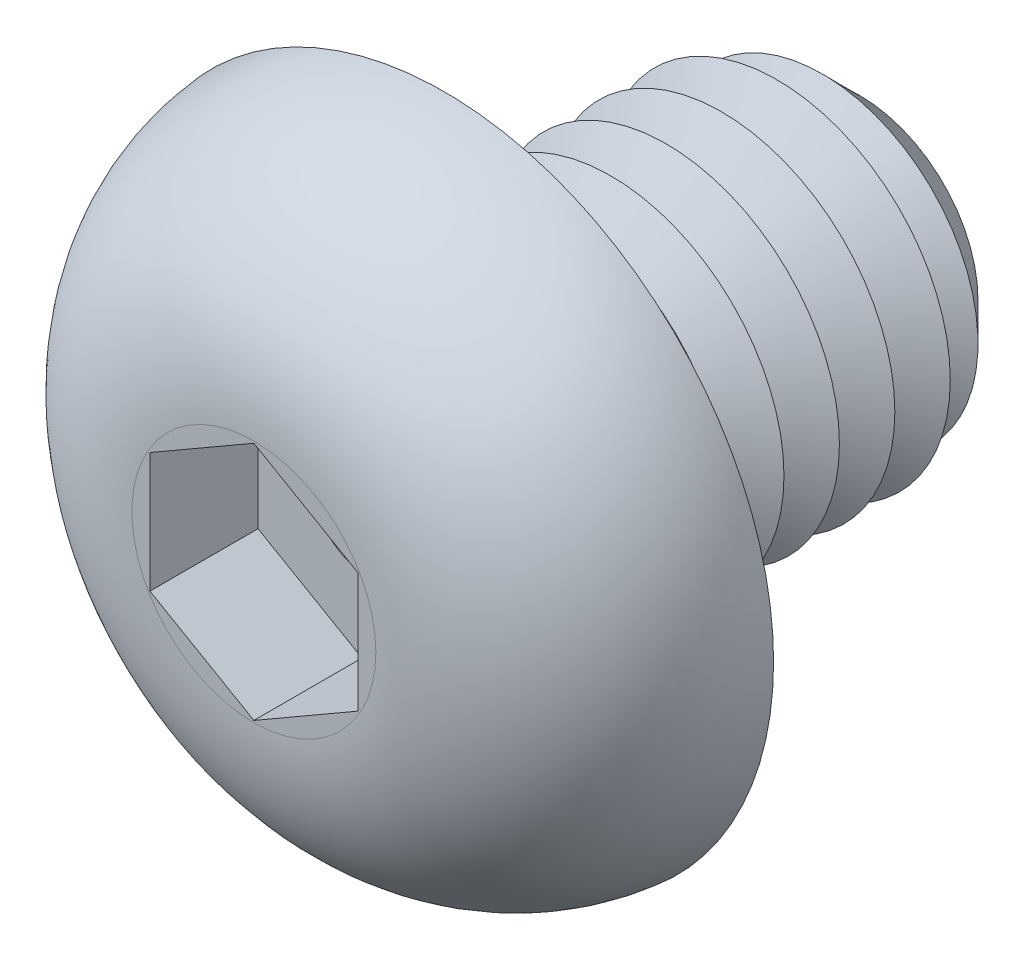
ISO-10303-21;
HEADER;
FILE_DESCRIPTION(('STEP AP214'),'2;1');
FILE_NAME('part.step','',(''),(''),'','','');
FILE_SCHEMA(('AUTOMOTIVE_DESIGN { 1 0 10303 214 1 1 1 1 }'));
ENDSEC;
DATA;
#1=APPLICATION_CONTEXT('core data for automotive mechanical design processes');
#2=APPLICATION_PROTOCOL_DEFINITION('international standard','automotive_design',2000,#1);
#3=PRODUCT_CONTEXT('',#1,'mechanical');
#4=PRODUCT('Part','Part','',(#3));
#5=PRODUCT_RELATED_PRODUCT_CATEGORY('part','',(#4));
#6=PRODUCT_DEFINITION_FORMATION('','',#4);
#7=PRODUCT_DEFINITION_CONTEXT('part definition',#1,'design');
#8=PRODUCT_DEFINITION('design','',#6,#7);
#9=PRODUCT_DEFINITION_SHAPE('','',#8);
#10=(LENGTH_UNIT() NAMED_UNIT(*) SI_UNIT(.MILLI.,.METRE.));
#11=(NAMED_UNIT(*) PLANE_ANGLE_UNIT() SI_UNIT($,.RADIAN.));
#12=(NAMED_UNIT(*) SI_UNIT($,.STERADIAN.) SOLID_ANGLE_UNIT());
#13=UNCERTAINTY_MEASURE_WITH_UNIT(LENGTH_MEASURE(1.E-05),#10,'distance_accuracy_value','');
#14=(GEOMETRIC_REPRESENTATION_CONTEXT(3) GLOBAL_UNCERTAINTY_ASSIGNED_CONTEXT((#13)) GLOBAL_UNIT_ASSIGNED_CONTEXT((#10,
#11,#12)) REPRESENTATION_CONTEXT('',''));
#15=CARTESIAN_POINT('',(0.,0.,0.));
#16=DIRECTION('',(0.,0.,1.));
#17=DIRECTION('',(1.,0.,0.));
#18=AXIS2_PLACEMENT_3D('',#15,#16,#17);
#19=CARTESIAN_POINT('',(0.,0.,-6.));
#20=DIRECTION('',(0.,0.,1.));
#21=DIRECTION('',(1.,0.,0.));
#22=AXIS2_PLACEMENT_3D('',#19,#20,#21);
#23=CYLINDRICAL_SURFACE('',#22,2.5);
#24=CARTESIAN_POINT('',(0.,0.,-0.4));
#25=DIRECTION('',(0.,0.,1.));
#26=DIRECTION('',(1.,0.,0.));
#27=AXIS2_PLACEMENT_3D('',#24,#25,#26);
#28=CIRCLE('',#27,2.5);
#29=CARTESIAN_POINT('',(2.5,0.,-0.4));
#30=VERTEX_POINT('',#29);
#31=EDGE_CURVE('E48',#30,#30,#28,.F.);
#32=ORIENTED_EDGE('',*,*,#31,.T.);
#33=EDGE_LOOP('',(#32));
#34=FACE_BOUND('',#33,.T.);
#35=CARTESIAN_POINT('',(0.,0.,-0.800000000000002));
#36=DIRECTION('',(0.,0.,1.));
#37=DIRECTION('',(1.,0.,0.));
#38=AXIS2_PLACEMENT_3D('',#35,#36,#37);
#39=CIRCLE('',#38,2.5);
#40=CARTESIAN_POINT('',(2.5,0.,-0.800000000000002));
#41=VERTEX_POINT('',#40);
#42=EDGE_CURVE('E137',#41,#41,#39,.T.);
#43=ORIENTED_EDGE('',*,*,#42,.T.);
#44=EDGE_LOOP('',(#43));
#45=FACE_BOUND('',#44,.T.);
#46=ADVANCED_FACE('F39',(#34,#45),#23,.T.);
#47=CARTESIAN_POINT('',(0.,4.75,0.));
#48=DIRECTION('',(0.,0.,1.));
#49=DIRECTION('',(1.,0.,0.));
#50=AXIS2_PLACEMENT_3D('',#47,#48,#49);
#51=PLANE('',#50);
#52=CARTESIAN_POINT('',(0.,0.,0.));
#53=DIRECTION('',(0.,0.,1.));
#54=DIRECTION('',(1.,0.,0.));
#55=AXIS2_PLACEMENT_3D('',#52,#53,#54);
#56=CIRCLE('',#55,2.9);
#57=CARTESIAN_POINT('',(2.9,0.,0.));
#58=VERTEX_POINT('',#57);
#59=EDGE_CURVE('E11',#58,#58,#56,.T.);
#60=ORIENTED_EDGE('',*,*,#59,.T.);
#61=EDGE_LOOP('',(#60));
#62=FACE_BOUND('',#61,.T.);
#63=CARTESIAN_POINT('',(0.,0.,0.));
#64=DIRECTION('',(0.,0.,1.));
#65=DIRECTION('',(1.,0.,0.));
#66=AXIS2_PLACEMENT_3D('',#63,#64,#65);
#67=CIRCLE('',#66,4.75);
#68=CARTESIAN_POINT('',(4.75,0.,0.));
#69=VERTEX_POINT('',#68);
#70=EDGE_CURVE('E156',#69,#69,#67,.T.);
#71=ORIENTED_EDGE('',*,*,#70,.F.);
#72=EDGE_LOOP('',(#71));
#73=FACE_BOUND('',#72,.T.);
#74=ADVANCED_FACE('F203',(#62,#73),#51,.F.);
#75=CARTESIAN_POINT('',(0.,0.,2.75));
#76=DIRECTION('',(0.,0.,-1.));
#77=DIRECTION('',(-1.,0.,0.));
#78=AXIS2_PLACEMENT_3D('',#75,#76,#77);
#79=PLANE('',#78);
#80=DIRECTION('',(-0.866025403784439,-0.5,0.));
#81=VECTOR('',#80,1.);
#82=CARTESIAN_POINT('',(0.,1.73205080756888,2.75));
#83=LINE('',#82,#81);
#84=CARTESIAN_POINT('',(0.,1.73205080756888,2.75));
#85=VERTEX_POINT('',#84);
#86=CARTESIAN_POINT('',(-1.5,0.866025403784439,2.75));
#87=VERTEX_POINT('',#86);
#88=EDGE_CURVE('E136',#85,#87,#83,.T.);
#89=ORIENTED_EDGE('',*,*,#88,.F.);
#90=DIRECTION('',(-0.866025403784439,0.5,0.));
#91=VECTOR('',#90,1.);
#92=CARTESIAN_POINT('',(1.5,0.86602540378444,2.75));
#93=LINE('',#92,#91);
#94=CARTESIAN_POINT('',(1.5,0.86602540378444,2.75));
#95=VERTEX_POINT('',#94);
#96=EDGE_CURVE('E55',#95,#85,#93,.T.);
#97=ORIENTED_EDGE('',*,*,#96,.F.);
#98=DIRECTION('',(0.,1.,0.));
#99=VECTOR('',#98,1.);
#100=CARTESIAN_POINT('',(1.5,-0.866025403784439,2.75));
#101=LINE('',#100,#99);
#102=CARTESIAN_POINT('',(1.5,-0.866025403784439,2.75));
#103=VERTEX_POINT('',#102);
#104=EDGE_CURVE('E150',#103,#95,#101,.T.);
#105=ORIENTED_EDGE('',*,*,#104,.F.);
#106=DIRECTION('',(0.866025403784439,0.5,0.));
#107=VECTOR('',#106,1.);
#108=CARTESIAN_POINT('',(0.,-1.73205080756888,2.75));
#109=LINE('',#108,#107);
#110=CARTESIAN_POINT('',(0.,-1.73205080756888,2.75));
#111=VERTEX_POINT('',#110);
#112=EDGE_CURVE('E147',#111,#103,#109,.T.);
#113=ORIENTED_EDGE('',*,*,#112,.F.);
#114=DIRECTION('',(0.866025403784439,-0.5,0.));
#115=VECTOR('',#114,1.);
#116=CARTESIAN_POINT('',(-1.5,-0.866025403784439,2.75));
#117=LINE('',#116,#115);
#118=CARTESIAN_POINT('',(-1.5,-0.866025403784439,2.75));
#119=VERTEX_POINT('',#118);
#120=EDGE_CURVE('E103',#119,#111,#117,.T.);
#121=ORIENTED_EDGE('',*,*,#120,.F.);
#122=DIRECTION('',(0.,-1.,0.));
#123=VECTOR('',#122,1.);
#124=CARTESIAN_POINT('',(-1.5,0.866025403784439,2.75));
#125=LINE('',#124,#123);
#126=EDGE_CURVE('E141',#87,#119,#125,.T.);
#127=ORIENTED_EDGE('',*,*,#126,.F.);
#128=EDGE_LOOP('',(#89,#97,#105,#113,#121,#127));
#129=FACE_BOUND('',#128,.T.);
#130=CARTESIAN_POINT('',(0.,0.,2.75));
#131=DIRECTION('',(0.,0.,1.));
#132=DIRECTION('',(1.,0.,0.));
#133=AXIS2_PLACEMENT_3D('',#130,#131,#132);
#134=CIRCLE('',#133,1.76043481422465);
#135=CARTESIAN_POINT('',(1.76043481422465,0.,2.75));
#136=VERTEX_POINT('',#135);
#137=EDGE_CURVE('E169',#136,#136,#134,.T.);
#138=ORIENTED_EDGE('',*,*,#137,.T.);
#139=EDGE_LOOP('',(#138));
#140=FACE_BOUND('',#139,.T.);
#141=ADVANCED_FACE('F208',(#129,#140),#79,.F.);
#142=CARTESIAN_POINT('',(0.,0.,-0.25));
#143=DIRECTION('',(0.,0.,1.));
#144=DIRECTION('',(1.,0.,0.));
#145=AXIS2_PLACEMENT_3D('',#142,#143,#144);
#146=DEGENERATE_TOROIDAL_SURFACE('',#145,1.76043481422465,3.,.T.);
#147=ORIENTED_EDGE('',*,*,#137,.F.);
#148=EDGE_LOOP('',(#147));
#149=FACE_BOUND('',#148,.T.);
#150=ORIENTED_EDGE('',*,*,#70,.T.);
#151=EDGE_LOOP('',(#150));
#152=FACE_BOUND('',#151,.T.);
#153=ADVANCED_FACE('F236',(#149,#152),#146,.T.);
#154=CARTESIAN_POINT('',(1.5,0.86602540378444,1.19));
#155=DIRECTION('',(0.5,0.866025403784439,0.));
#156=DIRECTION('',(-0.866025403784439,0.5,0.));
#157=AXIS2_PLACEMENT_3D('',#154,#155,#156);
#158=PLANE('',#157);
#159=ORIENTED_EDGE('',*,*,#96,.T.);
#160=DIRECTION('',(0.,0.,1.));
#161=VECTOR('',#160,1.);
#162=CARTESIAN_POINT('',(0.,1.73205080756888,1.19));
#163=LINE('',#162,#161);
#164=CARTESIAN_POINT('',(0.,1.73205080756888,1.19));
#165=VERTEX_POINT('',#164);
#166=EDGE_CURVE('E85',#165,#85,#163,.T.);
#167=ORIENTED_EDGE('',*,*,#166,.F.);
#168=DIRECTION('',(-0.866025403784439,0.5,0.));
#169=VECTOR('',#168,1.);
#170=CARTESIAN_POINT('',(1.5,0.86602540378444,1.19));
#171=LINE('',#170,#169);
#172=CARTESIAN_POINT('',(1.5,0.86602540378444,1.19));
#173=VERTEX_POINT('',#172);
#174=EDGE_CURVE('E153',#173,#165,#171,.T.);
#175=ORIENTED_EDGE('',*,*,#174,.F.);
#176=DIRECTION('',(0.,0.,1.));
#177=VECTOR('',#176,1.);
#178=CARTESIAN_POINT('',(1.5,0.86602540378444,1.19));
#179=LINE('',#178,#177);
#180=EDGE_CURVE('E63',#173,#95,#179,.T.);
#181=ORIENTED_EDGE('',*,*,#180,.T.);
#182=EDGE_LOOP('',(#159,#167,#175,#181));
#183=FACE_BOUND('',#182,.T.);
#184=ADVANCED_FACE('F222',(#183),#158,.F.);
#185=CARTESIAN_POINT('',(1.5,-0.866025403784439,1.19));
#186=DIRECTION('',(1.,0.,0.));
#187=DIRECTION('',(0.,1.,0.));
#188=AXIS2_PLACEMENT_3D('',#185,#186,#187);
#189=PLANE('',#188);
#190=ORIENTED_EDGE('',*,*,#104,.T.);
#191=ORIENTED_EDGE('',*,*,#180,.F.);
#192=DIRECTION('',(0.,1.,0.));
#193=VECTOR('',#192,1.);
#194=CARTESIAN_POINT('',(1.5,-0.866025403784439,1.19));
#195=LINE('',#194,#193);
#196=CARTESIAN_POINT('',(1.5,-0.866025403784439,1.19));
#197=VERTEX_POINT('',#196);
#198=EDGE_CURVE('E117',#197,#173,#195,.T.);
#199=ORIENTED_EDGE('',*,*,#198,.F.);
#200=DIRECTION('',(0.,0.,1.));
#201=VECTOR('',#200,1.);
#202=CARTESIAN_POINT('',(1.5,-0.866025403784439,1.19));
#203=LINE('',#202,#201);
#204=EDGE_CURVE('E108',#197,#103,#203,.T.);
#205=ORIENTED_EDGE('',*,*,#204,.T.);
#206=EDGE_LOOP('',(#190,#191,#199,#205));
#207=FACE_BOUND('',#206,.T.);
#208=ADVANCED_FACE('F219',(#207),#189,.F.);
#209=CARTESIAN_POINT('',(0.,-1.73205080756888,1.19));
#210=DIRECTION('',(0.5,-0.866025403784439,0.));
#211=DIRECTION('',(0.866025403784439,0.5,0.));
#212=AXIS2_PLACEMENT_3D('',#209,#210,#211);
#213=PLANE('',#212);
#214=ORIENTED_EDGE('',*,*,#112,.T.);
#215=ORIENTED_EDGE('',*,*,#204,.F.);
#216=DIRECTION('',(0.866025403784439,0.5,0.));
#217=VECTOR('',#216,1.);
#218=CARTESIAN_POINT('',(0.,-1.73205080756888,1.19));
#219=LINE('',#218,#217);
#220=CARTESIAN_POINT('',(0.,-1.73205080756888,1.19));
#221=VERTEX_POINT('',#220);
#222=EDGE_CURVE('E112',#221,#197,#219,.T.);
#223=ORIENTED_EDGE('',*,*,#222,.F.);
#224=DIRECTION('',(0.,0.,1.));
#225=VECTOR('',#224,1.);
#226=CARTESIAN_POINT('',(0.,-1.73205080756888,1.19));
#227=LINE('',#226,#225);
#228=EDGE_CURVE('E96',#221,#111,#227,.T.);
#229=ORIENTED_EDGE('',*,*,#228,.T.);
#230=EDGE_LOOP('',(#214,#215,#223,#229));
#231=FACE_BOUND('',#230,.T.);
#232=ADVANCED_FACE('F113',(#231),#213,.F.);
#233=CARTESIAN_POINT('',(-1.5,-0.866025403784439,1.19));
#234=DIRECTION('',(-0.5,-0.866025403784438,0.));
#235=DIRECTION('',(0.866025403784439,-0.5,0.));
#236=AXIS2_PLACEMENT_3D('',#233,#234,#235);
#237=PLANE('',#236);
#238=ORIENTED_EDGE('',*,*,#120,.T.);
#239=ORIENTED_EDGE('',*,*,#228,.F.);
#240=DIRECTION('',(0.866025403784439,-0.5,0.));
#241=VECTOR('',#240,1.);
#242=CARTESIAN_POINT('',(-1.5,-0.866025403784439,1.19));
#243=LINE('',#242,#241);
#244=CARTESIAN_POINT('',(-1.5,-0.866025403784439,1.19));
#245=VERTEX_POINT('',#244);
#246=EDGE_CURVE('E100',#245,#221,#243,.T.);
#247=ORIENTED_EDGE('',*,*,#246,.F.);
#248=DIRECTION('',(0.,0.,1.));
#249=VECTOR('',#248,1.);
#250=CARTESIAN_POINT('',(-1.5,-0.866025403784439,1.19));
#251=LINE('',#250,#249);
#252=EDGE_CURVE('E109',#245,#119,#251,.T.);
#253=ORIENTED_EDGE('',*,*,#252,.T.);
#254=EDGE_LOOP('',(#238,#239,#247,#253));
#255=FACE_BOUND('',#254,.T.);
#256=ADVANCED_FACE('F98',(#255),#237,.F.);
#257=CARTESIAN_POINT('',(-1.5,0.866025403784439,1.19));
#258=DIRECTION('',(-1.,0.,0.));
#259=DIRECTION('',(0.,-1.,0.));
#260=AXIS2_PLACEMENT_3D('',#257,#258,#259);
#261=PLANE('',#260);
#262=ORIENTED_EDGE('',*,*,#126,.T.);
#263=ORIENTED_EDGE('',*,*,#252,.F.);
#264=DIRECTION('',(0.,-1.,0.));
#265=VECTOR('',#264,1.);
#266=CARTESIAN_POINT('',(-1.5,0.866025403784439,1.19));
#267=LINE('',#266,#265);
#268=CARTESIAN_POINT('',(-1.5,0.866025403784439,1.19));
#269=VERTEX_POINT('',#268);
#270=EDGE_CURVE('E123',#269,#245,#267,.T.);
#271=ORIENTED_EDGE('',*,*,#270,.F.);
#272=DIRECTION('',(0.,0.,1.));
#273=VECTOR('',#272,1.);
#274=CARTESIAN_POINT('',(-1.5,0.866025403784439,1.19));
#275=LINE('',#274,#273);
#276=EDGE_CURVE('E161',#269,#87,#275,.T.);
#277=ORIENTED_EDGE('',*,*,#276,.T.);
#278=EDGE_LOOP('',(#262,#263,#271,#277));
#279=FACE_BOUND('',#278,.T.);
#280=ADVANCED_FACE('F227',(#279),#261,.F.);
#281=CARTESIAN_POINT('',(0.,1.73205080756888,1.19));
#282=DIRECTION('',(-0.5,0.866025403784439,0.));
#283=DIRECTION('',(-0.866025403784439,-0.5,0.));
#284=AXIS2_PLACEMENT_3D('',#281,#282,#283);
#285=PLANE('',#284);
#286=ORIENTED_EDGE('',*,*,#88,.T.);
#287=ORIENTED_EDGE('',*,*,#276,.F.);
#288=DIRECTION('',(-0.866025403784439,-0.5,0.));
#289=VECTOR('',#288,1.);
#290=CARTESIAN_POINT('',(0.,1.73205080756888,1.19));
#291=LINE('',#290,#289);
#292=EDGE_CURVE('E128',#165,#269,#291,.T.);
#293=ORIENTED_EDGE('',*,*,#292,.F.);
#294=ORIENTED_EDGE('',*,*,#166,.T.);
#295=EDGE_LOOP('',(#286,#287,#293,#294));
#296=FACE_BOUND('',#295,.T.);
#297=ADVANCED_FACE('F217',(#296),#285,.F.);
#298=CARTESIAN_POINT('',(0.,0.,1.19));
#299=DIRECTION('',(0.,0.,1.));
#300=DIRECTION('',(1.,0.,0.));
#301=AXIS2_PLACEMENT_3D('',#298,#299,#300);
#302=PLANE('',#301);
#303=CARTESIAN_POINT('',(0.,0.,1.19));
#304=DIRECTION('',(0.,0.,1.));
#305=DIRECTION('',(1.,0.,0.));
#306=AXIS2_PLACEMENT_3D('',#303,#304,#305);
#307=CIRCLE('',#306,0.65);
#308=CARTESIAN_POINT('',(0.65,0.,1.19));
#309=VERTEX_POINT('',#308);
#310=EDGE_CURVE('E303',#309,#309,#307,.T.);
#311=ORIENTED_EDGE('',*,*,#310,.F.);
#312=EDGE_LOOP('',(#311));
#313=FACE_BOUND('',#312,.T.);
#314=ORIENTED_EDGE('',*,*,#174,.T.);
#315=ORIENTED_EDGE('',*,*,#292,.T.);
#316=ORIENTED_EDGE('',*,*,#270,.T.);
#317=ORIENTED_EDGE('',*,*,#246,.T.);
#318=ORIENTED_EDGE('',*,*,#222,.T.);
#319=ORIENTED_EDGE('',*,*,#198,.T.);
#320=EDGE_LOOP('',(#314,#315,#316,#317,#318,#319));
#321=FACE_BOUND('',#320,.T.);
#322=ADVANCED_FACE('F120',(#313,#321),#302,.T.);
#323=CARTESIAN_POINT('',(0.,0.,-0.800000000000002));
#324=DIRECTION('',(0.,0.,1.));
#325=DIRECTION('',(1.,0.,0.));
#326=AXIS2_PLACEMENT_3D('',#323,#324,#325);
#327=CONICAL_SURFACE('',#326,2.5,1.0471975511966);
#328=CARTESIAN_POINT('',(0.,0.,-1.2));
#329=DIRECTION('',(0.,0.,1.));
#330=DIRECTION('',(1.,0.,0.));
#331=AXIS2_PLACEMENT_3D('',#328,#329,#330);
#332=CIRCLE('',#331,1.80717967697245);
#333=CARTESIAN_POINT('',(1.80717967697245,0.,-1.2));
#334=VERTEX_POINT('',#333);
#335=EDGE_CURVE('E259',#334,#334,#332,.T.);
#336=ORIENTED_EDGE('',*,*,#335,.T.);
#337=EDGE_LOOP('',(#336));
#338=FACE_BOUND('',#337,.T.);
#339=ORIENTED_EDGE('',*,*,#42,.F.);
#340=EDGE_LOOP('',(#339));
#341=FACE_BOUND('',#340,.T.);
#342=ADVANCED_FACE('F216',(#338,#341),#327,.T.);
#343=CARTESIAN_POINT('',(0.,0.,-1.2));
#344=DIRECTION('',(0.,0.,-1.));
#345=DIRECTION('',(-1.,0.,0.));
#346=AXIS2_PLACEMENT_3D('',#343,#344,#345);
#347=CONICAL_SURFACE('',#346,1.80717967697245,1.0471975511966);
#348=CARTESIAN_POINT('',(0.,0.,-1.6));
#349=DIRECTION('',(0.,0.,1.));
#350=DIRECTION('',(1.,0.,0.));
#351=AXIS2_PLACEMENT_3D('',#348,#349,#350);
#352=CIRCLE('',#351,2.5);
#353=CARTESIAN_POINT('',(2.5,0.,-1.6));
#354=VERTEX_POINT('',#353);
#355=EDGE_CURVE('E263',#354,#354,#352,.T.);
#356=ORIENTED_EDGE('',*,*,#355,.T.);
#357=EDGE_LOOP('',(#356));
#358=FACE_BOUND('',#357,.T.);
#359=ORIENTED_EDGE('',*,*,#335,.F.);
#360=EDGE_LOOP('',(#359));
#361=FACE_BOUND('',#360,.T.);
#362=ADVANCED_FACE('F373',(#358,#361),#347,.T.);
#363=CARTESIAN_POINT('',(0.,0.,-1.6));
#364=DIRECTION('',(0.,0.,1.));
#365=DIRECTION('',(1.,0.,0.));
#366=AXIS2_PLACEMENT_3D('',#363,#364,#365);
#367=CONICAL_SURFACE('',#366,2.5,1.0471975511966);
#368=CARTESIAN_POINT('',(0.,0.,-2.));
#369=DIRECTION('',(0.,0.,1.));
#370=DIRECTION('',(1.,0.,0.));
#371=AXIS2_PLACEMENT_3D('',#368,#369,#370);
#372=CIRCLE('',#371,1.80717967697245);
#373=CARTESIAN_POINT('',(1.80717967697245,0.,-2.));
#374=VERTEX_POINT('',#373);
#375=EDGE_CURVE('E267',#374,#374,#372,.T.);
#376=ORIENTED_EDGE('',*,*,#375,.T.);
#377=EDGE_LOOP('',(#376));
#378=FACE_BOUND('',#377,.T.);
#379=ORIENTED_EDGE('',*,*,#355,.F.);
#380=EDGE_LOOP('',(#379));
#381=FACE_BOUND('',#380,.T.);
#382=ADVANCED_FACE('F367',(#378,#381),#367,.T.);
#383=CARTESIAN_POINT('',(0.,0.,-2.));
#384=DIRECTION('',(0.,0.,-1.));
#385=DIRECTION('',(-1.,0.,0.));
#386=AXIS2_PLACEMENT_3D('',#383,#384,#385);
#387=CONICAL_SURFACE('',#386,1.80717967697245,1.0471975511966);
#388=CARTESIAN_POINT('',(0.,0.,-2.4));
#389=DIRECTION('',(0.,0.,1.));
#390=DIRECTION('',(1.,0.,0.));
#391=AXIS2_PLACEMENT_3D('',#388,#389,#390);
#392=CIRCLE('',#391,2.5);
#393=CARTESIAN_POINT('',(2.5,0.,-2.4));
#394=VERTEX_POINT('',#393);
#395=EDGE_CURVE('E271',#394,#394,#392,.T.);
#396=ORIENTED_EDGE('',*,*,#395,.T.);
#397=EDGE_LOOP('',(#396));
#398=FACE_BOUND('',#397,.T.);
#399=ORIENTED_EDGE('',*,*,#375,.F.);
#400=EDGE_LOOP('',(#399));
#401=FACE_BOUND('',#400,.T.);
#402=ADVANCED_FACE('F361',(#398,#401),#387,.T.);
#403=CARTESIAN_POINT('',(0.,0.,-2.4));
#404=DIRECTION('',(0.,0.,1.));
#405=DIRECTION('',(1.,0.,0.));
#406=AXIS2_PLACEMENT_3D('',#403,#404,#405);
#407=CONICAL_SURFACE('',#406,2.5,1.0471975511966);
#408=CARTESIAN_POINT('',(0.,0.,-2.8));
#409=DIRECTION('',(0.,0.,1.));
#410=DIRECTION('',(1.,0.,0.));
#411=AXIS2_PLACEMENT_3D('',#408,#409,#410);
#412=CIRCLE('',#411,1.80717967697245);
#413=CARTESIAN_POINT('',(1.80717967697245,0.,-2.8));
#414=VERTEX_POINT('',#413);
#415=EDGE_CURVE('E275',#414,#414,#412,.T.);
#416=ORIENTED_EDGE('',*,*,#415,.T.);
#417=EDGE_LOOP('',(#416));
#418=FACE_BOUND('',#417,.T.);
#419=ORIENTED_EDGE('',*,*,#395,.F.);
#420=EDGE_LOOP('',(#419));
#421=FACE_BOUND('',#420,.T.);
#422=ADVANCED_FACE('F355',(#418,#421),#407,.T.);
#423=CARTESIAN_POINT('',(0.,0.,-2.8));
#424=DIRECTION('',(0.,0.,-1.));
#425=DIRECTION('',(-1.,0.,0.));
#426=AXIS2_PLACEMENT_3D('',#423,#424,#425);
#427=CONICAL_SURFACE('',#426,1.80717967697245,1.0471975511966);
#428=CARTESIAN_POINT('',(0.,0.,-3.2));
#429=DIRECTION('',(0.,0.,1.));
#430=DIRECTION('',(1.,0.,0.));
#431=AXIS2_PLACEMENT_3D('',#428,#429,#430);
#432=CIRCLE('',#431,2.5);
#433=CARTESIAN_POINT('',(2.5,0.,-3.2));
#434=VERTEX_POINT('',#433);
#435=EDGE_CURVE('E279',#434,#434,#432,.T.);
#436=ORIENTED_EDGE('',*,*,#435,.T.);
#437=EDGE_LOOP('',(#436));
#438=FACE_BOUND('',#437,.T.);
#439=ORIENTED_EDGE('',*,*,#415,.F.);
#440=EDGE_LOOP('',(#439));
#441=FACE_BOUND('',#440,.T.);
#442=ADVANCED_FACE('F349',(#438,#441),#427,.T.);
#443=CARTESIAN_POINT('',(0.,0.,-3.2));
#444=DIRECTION('',(0.,0.,1.));
#445=DIRECTION('',(1.,0.,0.));
#446=AXIS2_PLACEMENT_3D('',#443,#444,#445);
#447=CONICAL_SURFACE('',#446,2.5,1.0471975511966);
#448=CARTESIAN_POINT('',(0.,0.,-3.6));
#449=DIRECTION('',(0.,0.,1.));
#450=DIRECTION('',(1.,0.,0.));
#451=AXIS2_PLACEMENT_3D('',#448,#449,#450);
#452=CIRCLE('',#451,1.80717967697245);
#453=CARTESIAN_POINT('',(1.80717967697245,0.,-3.6));
#454=VERTEX_POINT('',#453);
#455=EDGE_CURVE('E283',#454,#454,#452,.T.);
#456=ORIENTED_EDGE('',*,*,#455,.T.);
#457=EDGE_LOOP('',(#456));
#458=FACE_BOUND('',#457,.T.);
#459=ORIENTED_EDGE('',*,*,#435,.F.);
#460=EDGE_LOOP('',(#459));
#461=FACE_BOUND('',#460,.T.);
#462=ADVANCED_FACE('F343',(#458,#461),#447,.T.);
#463=CARTESIAN_POINT('',(0.,0.,-3.6));
#464=DIRECTION('',(0.,0.,-1.));
#465=DIRECTION('',(-1.,0.,0.));
#466=AXIS2_PLACEMENT_3D('',#463,#464,#465);
#467=CONICAL_SURFACE('',#466,1.80717967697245,1.0471975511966);
#468=CARTESIAN_POINT('',(0.,0.,-4.));
#469=DIRECTION('',(0.,0.,1.));
#470=DIRECTION('',(1.,0.,0.));
#471=AXIS2_PLACEMENT_3D('',#468,#469,#470);
#472=CIRCLE('',#471,2.5);
#473=CARTESIAN_POINT('',(2.5,0.,-4.));
#474=VERTEX_POINT('',#473);
#475=EDGE_CURVE('E287',#474,#474,#472,.T.);
#476=ORIENTED_EDGE('',*,*,#475,.T.);
#477=EDGE_LOOP('',(#476));
#478=FACE_BOUND('',#477,.T.);
#479=ORIENTED_EDGE('',*,*,#455,.F.);
#480=EDGE_LOOP('',(#479));
#481=FACE_BOUND('',#480,.T.);
#482=ADVANCED_FACE('F337',(#478,#481),#467,.T.);
#483=CARTESIAN_POINT('',(0.,0.,-4.));
#484=DIRECTION('',(0.,0.,1.));
#485=DIRECTION('',(1.,0.,0.));
#486=AXIS2_PLACEMENT_3D('',#483,#484,#485);
#487=CONICAL_SURFACE('',#486,2.5,1.0471975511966);
#488=CARTESIAN_POINT('',(0.,0.,-4.4));
#489=DIRECTION('',(0.,0.,1.));
#490=DIRECTION('',(1.,0.,0.));
#491=AXIS2_PLACEMENT_3D('',#488,#489,#490);
#492=CIRCLE('',#491,1.80717967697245);
#493=CARTESIAN_POINT('',(1.80717967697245,0.,-4.4));
#494=VERTEX_POINT('',#493);
#495=EDGE_CURVE('E180',#494,#494,#492,.T.);
#496=ORIENTED_EDGE('',*,*,#495,.T.);
#497=EDGE_LOOP('',(#496));
#498=FACE_BOUND('',#497,.T.);
#499=ORIENTED_EDGE('',*,*,#475,.F.);
#500=EDGE_LOOP('',(#499));
#501=FACE_BOUND('',#500,.T.);
#502=ADVANCED_FACE('F331',(#498,#501),#487,.T.);
#503=CARTESIAN_POINT('',(0.,0.,-4.4));
#504=DIRECTION('',(0.,0.,-1.));
#505=DIRECTION('',(-1.,0.,0.));
#506=AXIS2_PLACEMENT_3D('',#503,#504,#505);
#507=CONICAL_SURFACE('',#506,1.80717967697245,1.0471975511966);
#508=CARTESIAN_POINT('',(0.,0.,-4.8));
#509=DIRECTION('',(0.,0.,1.));
#510=DIRECTION('',(1.,0.,0.));
#511=AXIS2_PLACEMENT_3D('',#508,#509,#510);
#512=CIRCLE('',#511,2.5);
#513=CARTESIAN_POINT('',(2.5,0.,-4.8));
#514=VERTEX_POINT('',#513);
#515=EDGE_CURVE('E181',#514,#514,#512,.T.);
#516=ORIENTED_EDGE('',*,*,#515,.T.);
#517=EDGE_LOOP('',(#516));
#518=FACE_BOUND('',#517,.T.);
#519=ORIENTED_EDGE('',*,*,#495,.F.);
#520=EDGE_LOOP('',(#519));
#521=FACE_BOUND('',#520,.T.);
#522=ADVANCED_FACE('F325',(#518,#521),#507,.T.);
#523=CARTESIAN_POINT('',(0.,0.,-4.8));
#524=DIRECTION('',(0.,0.,1.));
#525=DIRECTION('',(1.,0.,0.));
#526=AXIS2_PLACEMENT_3D('',#523,#524,#525);
#527=CONICAL_SURFACE('',#526,2.5,1.0471975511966);
#528=CARTESIAN_POINT('',(0.,0.,-5.2));
#529=DIRECTION('',(0.,0.,1.));
#530=DIRECTION('',(1.,0.,0.));
#531=AXIS2_PLACEMENT_3D('',#528,#529,#530);
#532=CIRCLE('',#531,1.80717967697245);
#533=CARTESIAN_POINT('',(1.80717967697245,0.,-5.2));
#534=VERTEX_POINT('',#533);
#535=EDGE_CURVE('E296',#534,#534,#532,.T.);
#536=ORIENTED_EDGE('',*,*,#535,.T.);
#537=EDGE_LOOP('',(#536));
#538=FACE_BOUND('',#537,.T.);
#539=ORIENTED_EDGE('',*,*,#515,.F.);
#540=EDGE_LOOP('',(#539));
#541=FACE_BOUND('',#540,.T.);
#542=ADVANCED_FACE('F319',(#538,#541),#527,.T.);
#543=CARTESIAN_POINT('',(0.,0.,-5.2));
#544=DIRECTION('',(0.,0.,-1.));
#545=DIRECTION('',(-1.,0.,0.));
#546=AXIS2_PLACEMENT_3D('',#543,#544,#545);
#547=CONICAL_SURFACE('',#546,1.80717967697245,1.0471975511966);
#548=CARTESIAN_POINT('',(0.,0.,-5.45358983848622));
#549=DIRECTION('',(0.,0.,-1.));
#550=DIRECTION('',(-1.,0.,0.));
#551=AXIS2_PLACEMENT_3D('',#548,#549,#550);
#552=CIRCLE('',#551,2.24641016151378);
#553=CARTESIAN_POINT('',(-2.24641016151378,0.,-5.45358983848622));
#554=VERTEX_POINT('',#553);
#555=EDGE_CURVE('E177',#554,#554,#552,.T.);
#556=ORIENTED_EDGE('',*,*,#555,.F.);
#557=EDGE_LOOP('',(#556));
#558=FACE_BOUND('',#557,.T.);
#559=ORIENTED_EDGE('',*,*,#535,.F.);
#560=EDGE_LOOP('',(#559));
#561=FACE_BOUND('',#560,.T.);
#562=ADVANCED_FACE('F312',(#558,#561),#547,.T.);
#563=CARTESIAN_POINT('',(0.,0.,-6.));
#564=DIRECTION('',(0.,0.,-1.));
#565=DIRECTION('',(-1.,0.,0.));
#566=AXIS2_PLACEMENT_3D('',#563,#564,#565);
#567=PLANE('',#566);
#568=CARTESIAN_POINT('',(0.,0.,-6.));
#569=DIRECTION('',(0.,0.,-1.));
#570=DIRECTION('',(-1.,0.,0.));
#571=AXIS2_PLACEMENT_3D('',#568,#569,#570);
#572=CIRCLE('',#571,0.65);
#573=CARTESIAN_POINT('',(-0.65,0.,-6.));
#574=VERTEX_POINT('',#573);
#575=EDGE_CURVE('E300',#574,#574,#572,.F.);
#576=ORIENTED_EDGE('',*,*,#575,.T.);
#577=EDGE_LOOP('',(#576));
#578=FACE_BOUND('',#577,.T.);
#579=CARTESIAN_POINT('',(0.,0.,-6.));
#580=DIRECTION('',(0.,0.,-1.));
#581=DIRECTION('',(-1.,0.,0.));
#582=AXIS2_PLACEMENT_3D('',#579,#580,#581);
#583=CIRCLE('',#582,1.7);
#584=CARTESIAN_POINT('',(-1.7,0.,-6.));
#585=VERTEX_POINT('',#584);
#586=EDGE_CURVE('E173',#585,#585,#583,.T.);
#587=ORIENTED_EDGE('',*,*,#586,.T.);
#588=EDGE_LOOP('',(#587));
#589=FACE_BOUND('',#588,.T.);
#590=ADVANCED_FACE('F199',(#578,#589),#567,.T.);
#591=CARTESIAN_POINT('',(0.,0.,-6.));
#592=DIRECTION('',(0.,0.,1.));
#593=DIRECTION('',(1.,0.,0.));
#594=AXIS2_PLACEMENT_3D('',#591,#592,#593);
#595=CONICAL_SURFACE('',#594,1.7,0.785398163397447);
#596=ORIENTED_EDGE('',*,*,#586,.F.);
#597=EDGE_LOOP('',(#596));
#598=FACE_BOUND('',#597,.T.);
#599=ORIENTED_EDGE('',*,*,#555,.T.);
#600=EDGE_LOOP('',(#599));
#601=FACE_BOUND('',#600,.T.);
#602=ADVANCED_FACE('F191',(#598,#601),#595,.T.);
#603=CARTESIAN_POINT('',(0.,0.,-0.4));
#604=DIRECTION('',(0.,0.,1.));
#605=DIRECTION('',(1.,0.,0.));
#606=AXIS2_PLACEMENT_3D('',#603,#604,#605);
#607=TOROIDAL_SURFACE('',#606,2.9,0.4);
#608=ORIENTED_EDGE('',*,*,#59,.F.);
#609=EDGE_LOOP('',(#608));
#610=FACE_BOUND('',#609,.T.);
#611=ORIENTED_EDGE('',*,*,#31,.F.);
#612=EDGE_LOOP('',(#611));
#613=FACE_BOUND('',#612,.T.);
#614=ADVANCED_FACE('F41',(#610,#613),#607,.F.);
#615=CARTESIAN_POINT('',(0.,0.,-7.83847763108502));
#616=DIRECTION('',(0.,0.,1.));
#617=DIRECTION('',(1.,0.,0.));
#618=AXIS2_PLACEMENT_3D('',#615,#616,#617);
#619=CYLINDRICAL_SURFACE('',#618,0.65);
#620=ORIENTED_EDGE('',*,*,#310,.T.);
#621=EDGE_LOOP('',(#620));
#622=FACE_BOUND('',#621,.T.);
#623=ORIENTED_EDGE('',*,*,#575,.F.);
#624=EDGE_LOOP('',(#623));
#625=FACE_BOUND('',#624,.T.);
#626=ADVANCED_FACE('F190',(#622,#625),#619,.F.);
#627=CLOSED_SHELL('',(#46,#74,#141,#153,#184,#208,#232,#256,#280,#297,#322,#342,#362,#382,#402,
#422,#442,#462,#482,#502,#522,#542,#562,#590,#602,#614,#626));
#628=MANIFOLD_SOLID_BREP('B2',#627);
#629=ADVANCED_BREP_SHAPE_REPRESENTATION('',(#18,#628),#14);
#630=SHAPE_DEFINITION_REPRESENTATION(#9,#629);
ENDSEC;
END-ISO-10303-21;
